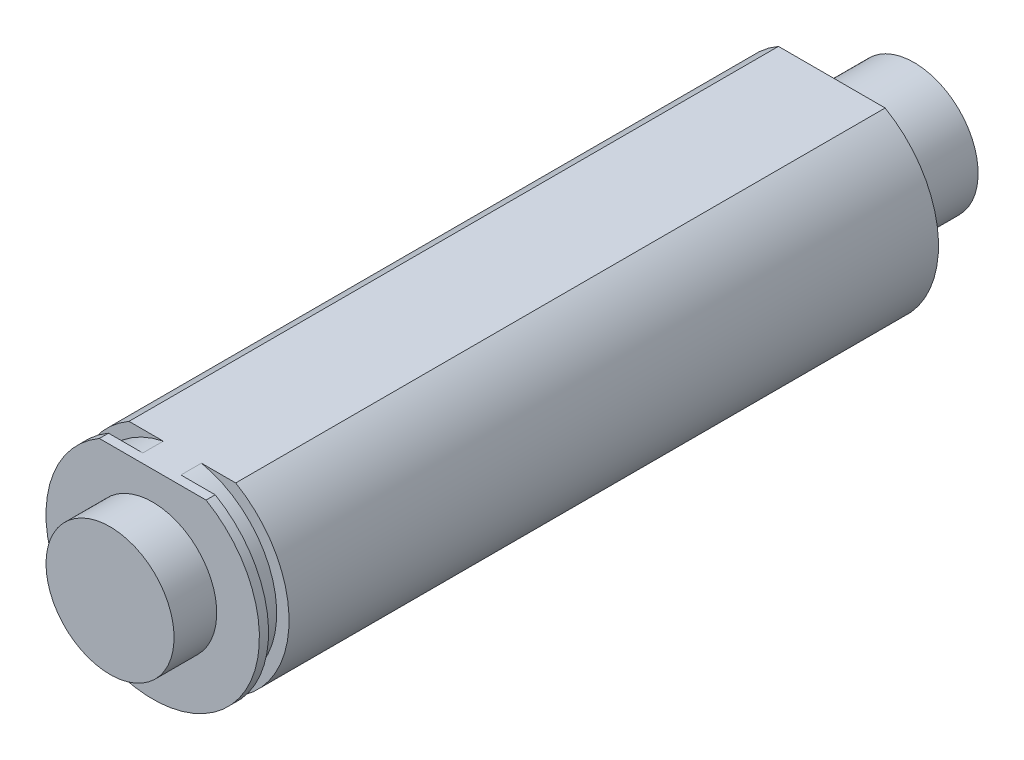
ISO-10303-21;
HEADER;
FILE_DESCRIPTION(('STEP AP214'),'2;1');
FILE_NAME('part.step','',(''),(''),'','','');
FILE_SCHEMA(('AUTOMOTIVE_DESIGN { 1 0 10303 214 1 1 1 1 }'));
ENDSEC;
DATA;
#1=APPLICATION_CONTEXT('core data for automotive mechanical design processes');
#2=APPLICATION_PROTOCOL_DEFINITION('international standard','automotive_design',2000,#1);
#3=PRODUCT_CONTEXT('',#1,'mechanical');
#4=PRODUCT('Part','Part','',(#3));
#5=PRODUCT_RELATED_PRODUCT_CATEGORY('part','',(#4));
#6=PRODUCT_DEFINITION_FORMATION('','',#4);
#7=PRODUCT_DEFINITION_CONTEXT('part definition',#1,'design');
#8=PRODUCT_DEFINITION('design','',#6,#7);
#9=PRODUCT_DEFINITION_SHAPE('','',#8);
#10=(LENGTH_UNIT() NAMED_UNIT(*) SI_UNIT(.MILLI.,.METRE.));
#11=(NAMED_UNIT(*) PLANE_ANGLE_UNIT() SI_UNIT($,.RADIAN.));
#12=(NAMED_UNIT(*) SI_UNIT($,.STERADIAN.) SOLID_ANGLE_UNIT());
#13=UNCERTAINTY_MEASURE_WITH_UNIT(LENGTH_MEASURE(1.E-05),#10,'distance_accuracy_value','');
#14=(GEOMETRIC_REPRESENTATION_CONTEXT(3) GLOBAL_UNCERTAINTY_ASSIGNED_CONTEXT((#13)) GLOBAL_UNIT_ASSIGNED_CONTEXT((#10,
#11,#12)) REPRESENTATION_CONTEXT('',''));
#15=CARTESIAN_POINT('',(0.,0.,0.));
#16=DIRECTION('',(0.,0.,1.));
#17=DIRECTION('',(1.,0.,0.));
#18=AXIS2_PLACEMENT_3D('',#15,#16,#17);
#19=CARTESIAN_POINT('',(0.,0.,152.4));
#20=DIRECTION('',(0.,0.,-1.));
#21=DIRECTION('',(-1.,0.,0.));
#22=AXIS2_PLACEMENT_3D('',#19,#20,#21);
#23=CYLINDRICAL_SURFACE('',#22,7.9375);
#24=CARTESIAN_POINT('',(0.,0.,-88.261902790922));
#25=DIRECTION('',(0.,0.,1.));
#26=DIRECTION('',(1.,0.,0.));
#27=AXIS2_PLACEMENT_3D('',#24,#25,#26);
#28=CIRCLE('',#27,7.93750000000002);
#29=CARTESIAN_POINT('',(-3.96875000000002,6.87407664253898,-88.261902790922));
#30=VERTEX_POINT('',#29);
#31=CARTESIAN_POINT('',(3.96875000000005,6.87407664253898,-88.261902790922));
#32=VERTEX_POINT('',#31);
#33=EDGE_CURVE('E124',#30,#32,#28,.T.);
#34=ORIENTED_EDGE('',*,*,#33,.F.);
#35=DIRECTION('',(0.,0.,1.));
#36=VECTOR('',#35,1.);
#37=CARTESIAN_POINT('',(-3.96875,6.87407664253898,-152.4));
#38=LINE('',#37,#36);
#39=CARTESIAN_POINT('',(-3.96875,6.87407664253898,-136.572201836));
#40=VERTEX_POINT('',#39);
#41=EDGE_CURVE('E120',#40,#30,#38,.T.);
#42=ORIENTED_EDGE('',*,*,#41,.F.);
#43=CARTESIAN_POINT('',(0.,0.,-136.572201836));
#44=DIRECTION('',(0.,0.,-1.));
#45=DIRECTION('',(-1.,0.,0.));
#46=AXIS2_PLACEMENT_3D('',#43,#44,#45);
#47=CIRCLE('',#46,7.9375);
#48=CARTESIAN_POINT('',(3.96875,6.87407664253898,-136.572201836));
#49=VERTEX_POINT('',#48);
#50=EDGE_CURVE('E70',#49,#40,#47,.T.);
#51=ORIENTED_EDGE('',*,*,#50,.F.);
#52=DIRECTION('',(0.,0.,1.));
#53=VECTOR('',#52,1.);
#54=CARTESIAN_POINT('',(3.96875,6.87407664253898,-152.4));
#55=LINE('',#54,#53);
#56=EDGE_CURVE('E129',#49,#32,#55,.T.);
#57=ORIENTED_EDGE('',*,*,#56,.T.);
#58=EDGE_LOOP('',(#34,#42,#51,#57));
#59=FACE_BOUND('',#58,.T.);
#60=ADVANCED_FACE('F48',(#59),#23,.T.);
#61=CARTESIAN_POINT('',(0.,0.,-86.737902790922));
#62=DIRECTION('',(0.,0.,1.));
#63=DIRECTION('',(1.,0.,0.));
#64=AXIS2_PLACEMENT_3D('',#61,#62,#63);
#65=CIRCLE('',#64,7.93750000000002);
#66=CARTESIAN_POINT('',(-3.96875000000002,6.87407664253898,-86.737902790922));
#67=VERTEX_POINT('',#66);
#68=CARTESIAN_POINT('',(3.96875000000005,6.87407664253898,-86.737902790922));
#69=VERTEX_POINT('',#68);
#70=EDGE_CURVE('E101',#67,#69,#65,.T.);
#71=ORIENTED_EDGE('',*,*,#70,.T.);
#72=CARTESIAN_POINT('',(3.96875,6.87407664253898,-86.057548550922));
#73=VERTEX_POINT('',#72);
#74=EDGE_CURVE('E149',#69,#73,#55,.T.);
#75=ORIENTED_EDGE('',*,*,#74,.T.);
#76=CARTESIAN_POINT('',(0.,0.,-86.057548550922));
#77=DIRECTION('',(0.,0.,-1.));
#78=DIRECTION('',(-1.,0.,0.));
#79=AXIS2_PLACEMENT_3D('',#76,#77,#78);
#80=CIRCLE('',#79,7.9375);
#81=CARTESIAN_POINT('',(-3.96875,6.87407664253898,-86.057548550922));
#82=VERTEX_POINT('',#81);
#83=EDGE_CURVE('E137',#73,#82,#80,.T.);
#84=ORIENTED_EDGE('',*,*,#83,.T.);
#85=EDGE_CURVE('E146',#67,#82,#38,.T.);
#86=ORIENTED_EDGE('',*,*,#85,.F.);
#87=EDGE_LOOP('',(#71,#75,#84,#86));
#88=FACE_BOUND('',#87,.T.);
#89=ADVANCED_FACE('F157',(#88),#23,.T.);
#90=CARTESIAN_POINT('',(-3.96875,6.87407664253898,-152.4));
#91=DIRECTION('',(0.,-1.,0.));
#92=DIRECTION('',(0.,0.,-1.));
#93=AXIS2_PLACEMENT_3D('',#90,#91,#92);
#94=PLANE('',#93);
#95=DIRECTION('',(-1.,0.,0.));
#96=VECTOR('',#95,1.);
#97=CARTESIAN_POINT('',(-3.96874999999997,6.87407664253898,-88.261902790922));
#98=LINE('',#97,#96);
#99=CARTESIAN_POINT('',(-1.41811328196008,6.87407664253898,-88.261902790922));
#100=VERTEX_POINT('',#99);
#101=EDGE_CURVE('E12',#100,#30,#98,.T.);
#102=ORIENTED_EDGE('',*,*,#101,.F.);
#103=DIRECTION('',(0.,0.,1.));
#104=VECTOR('',#103,1.);
#105=CARTESIAN_POINT('',(-1.41811328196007,6.87407664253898,-83.930701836));
#106=LINE('',#105,#104);
#107=CARTESIAN_POINT('',(-1.41811328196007,6.87407664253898,-86.737902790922));
#108=VERTEX_POINT('',#107);
#109=EDGE_CURVE('E51',#108,#100,#106,.F.);
#110=ORIENTED_EDGE('',*,*,#109,.F.);
#111=DIRECTION('',(1.,0.,0.));
#112=VECTOR('',#111,1.);
#113=CARTESIAN_POINT('',(-3.96874999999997,6.87407664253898,-86.737902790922));
#114=LINE('',#113,#112);
#115=EDGE_CURVE('E98',#67,#108,#114,.T.);
#116=ORIENTED_EDGE('',*,*,#115,.F.);
#117=ORIENTED_EDGE('',*,*,#85,.T.);
#118=DIRECTION('',(1.,0.,0.));
#119=VECTOR('',#118,1.);
#120=CARTESIAN_POINT('',(-3.96875,6.87407664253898,-86.057548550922));
#121=LINE('',#120,#119);
#122=EDGE_CURVE('E148',#82,#73,#121,.T.);
#123=ORIENTED_EDGE('',*,*,#122,.T.);
#124=ORIENTED_EDGE('',*,*,#74,.F.);
#125=CARTESIAN_POINT('',(1.4181132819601,6.87407664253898,-86.737902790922));
#126=VERTEX_POINT('',#125);
#127=EDGE_CURVE('E106',#126,#69,#114,.T.);
#128=ORIENTED_EDGE('',*,*,#127,.F.);
#129=DIRECTION('',(0.,0.,1.));
#130=VECTOR('',#129,1.);
#131=CARTESIAN_POINT('',(1.41811328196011,6.87407664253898,-83.930701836));
#132=LINE('',#131,#130);
#133=CARTESIAN_POINT('',(1.41811328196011,6.87407664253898,-88.261902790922));
#134=VERTEX_POINT('',#133);
#135=EDGE_CURVE('E112',#134,#126,#132,.T.);
#136=ORIENTED_EDGE('',*,*,#135,.F.);
#137=EDGE_CURVE('E56',#32,#134,#98,.T.);
#138=ORIENTED_EDGE('',*,*,#137,.F.);
#139=ORIENTED_EDGE('',*,*,#56,.F.);
#140=DIRECTION('',(1.,0.,0.));
#141=VECTOR('',#140,1.);
#142=CARTESIAN_POINT('',(-3.96875,6.87407664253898,-136.572201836));
#143=LINE('',#142,#141);
#144=EDGE_CURVE('E153',#40,#49,#143,.T.);
#145=ORIENTED_EDGE('',*,*,#144,.F.);
#146=ORIENTED_EDGE('',*,*,#41,.T.);
#147=EDGE_LOOP('',(#102,#110,#116,#117,#123,#124,#128,#136,#138,#139,#145,#146));
#148=FACE_BOUND('',#147,.T.);
#149=ADVANCED_FACE('F117',(#148),#94,.F.);
#150=CARTESIAN_POINT('',(-7.9375,0.,-86.057548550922));
#151=DIRECTION('',(0.,0.,-1.));
#152=DIRECTION('',(-1.,0.,0.));
#153=AXIS2_PLACEMENT_3D('',#150,#151,#152);
#154=PLANE('',#153);
#155=CARTESIAN_POINT('',(0.,0.,-86.057548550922));
#156=DIRECTION('',(0.,0.,-1.));
#157=DIRECTION('',(-1.,0.,0.));
#158=AXIS2_PLACEMENT_3D('',#155,#156,#157);
#159=CIRCLE('',#158,4.76249999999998);
#160=CARTESIAN_POINT('',(-4.76249999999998,0.,-86.057548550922));
#161=VERTEX_POINT('',#160);
#162=EDGE_CURVE('E140',#161,#161,#159,.T.);
#163=ORIENTED_EDGE('',*,*,#162,.T.);
#164=EDGE_LOOP('',(#163));
#165=FACE_BOUND('',#164,.T.);
#166=ORIENTED_EDGE('',*,*,#83,.F.);
#167=ORIENTED_EDGE('',*,*,#122,.F.);
#168=EDGE_LOOP('',(#166,#167));
#169=FACE_BOUND('',#168,.T.);
#170=ADVANCED_FACE('F187',(#165,#169),#154,.F.);
#171=CARTESIAN_POINT('',(-4.76249999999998,0.,-82.882548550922));
#172=DIRECTION('',(0.,0.,-1.));
#173=DIRECTION('',(-1.,0.,0.));
#174=AXIS2_PLACEMENT_3D('',#171,#172,#173);
#175=PLANE('',#174);
#176=CARTESIAN_POINT('',(0.,0.,-82.882548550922));
#177=DIRECTION('',(0.,0.,-1.));
#178=DIRECTION('',(-1.,0.,0.));
#179=AXIS2_PLACEMENT_3D('',#176,#177,#178);
#180=CIRCLE('',#179,4.76249999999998);
#181=CARTESIAN_POINT('',(-4.76249999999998,0.,-82.882548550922));
#182=VERTEX_POINT('',#181);
#183=EDGE_CURVE('E143',#182,#182,#180,.T.);
#184=ORIENTED_EDGE('',*,*,#183,.F.);
#185=EDGE_LOOP('',(#184));
#186=FACE_BOUND('',#185,.T.);
#187=ADVANCED_FACE('F191',(#186),#175,.F.);
#188=CARTESIAN_POINT('',(0.,0.,0.));
#189=DIRECTION('',(0.,0.,-1.));
#190=DIRECTION('',(-1.,0.,0.));
#191=AXIS2_PLACEMENT_3D('',#188,#189,#190);
#192=CYLINDRICAL_SURFACE('',#191,4.76249999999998);
#193=ORIENTED_EDGE('',*,*,#162,.F.);
#194=EDGE_LOOP('',(#193));
#195=FACE_BOUND('',#194,.T.);
#196=ORIENTED_EDGE('',*,*,#183,.T.);
#197=EDGE_LOOP('',(#196));
#198=FACE_BOUND('',#197,.T.);
#199=ADVANCED_FACE('F177',(#195,#198),#192,.T.);
#200=CARTESIAN_POINT('',(0.,0.,-136.572201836));
#201=DIRECTION('',(0.,0.,-1.));
#202=DIRECTION('',(-1.,0.,0.));
#203=AXIS2_PLACEMENT_3D('',#200,#201,#202);
#204=PLANE('',#203);
#205=CARTESIAN_POINT('',(0.,0.,-136.572201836));
#206=DIRECTION('',(0.,0.,-1.));
#207=DIRECTION('',(-1.,0.,0.));
#208=AXIS2_PLACEMENT_3D('',#205,#206,#207);
#209=CIRCLE('',#208,4.7625);
#210=CARTESIAN_POINT('',(-4.7625,0.,-136.572201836));
#211=VERTEX_POINT('',#210);
#212=EDGE_CURVE('E130',#211,#211,#209,.T.);
#213=ORIENTED_EDGE('',*,*,#212,.F.);
#214=EDGE_LOOP('',(#213));
#215=FACE_BOUND('',#214,.T.);
#216=ORIENTED_EDGE('',*,*,#50,.T.);
#217=ORIENTED_EDGE('',*,*,#144,.T.);
#218=EDGE_LOOP('',(#216,#217));
#219=FACE_BOUND('',#218,.T.);
#220=ADVANCED_FACE('F169',(#215,#219),#204,.T.);
#221=CARTESIAN_POINT('',(0.,0.,-136.572201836));
#222=DIRECTION('',(0.,0.,-1.));
#223=DIRECTION('',(-1.,0.,0.));
#224=AXIS2_PLACEMENT_3D('',#221,#222,#223);
#225=CYLINDRICAL_SURFACE('',#224,4.7625);
#226=CARTESIAN_POINT('',(1.22124532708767E-12,-7.7715611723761E-13,-142.693601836));
#227=DIRECTION('',(0.,0.,-1.));
#228=DIRECTION('',(-1.,0.,0.));
#229=AXIS2_PLACEMENT_3D('',#226,#227,#228);
#230=CIRCLE('',#229,4.76250000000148);
#231=CARTESIAN_POINT('',(-4.7625,0.,-142.693601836));
#232=VERTEX_POINT('',#231);
#233=EDGE_CURVE('E159',#232,#232,#230,.T.);
#234=CARTESIAN_POINT('',(-4.7625,0.,-136.572201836));
#235=CARTESIAN_POINT('',(-4.7625,0.,-136.635966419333));
#236=CARTESIAN_POINT('',(-4.7625,0.,-136.699731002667));
#237=CARTESIAN_POINT('',(-4.7625,0.,-136.827260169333));
#238=CARTESIAN_POINT('',(-4.7625,0.,-136.891024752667));
#239=CARTESIAN_POINT('',(-4.7625,0.,-137.018553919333));
#240=CARTESIAN_POINT('',(-4.7625,0.,-137.082318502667));
#241=CARTESIAN_POINT('',(-4.7625,0.,-137.209847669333));
#242=CARTESIAN_POINT('',(-4.7625,0.,-137.273612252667));
#243=CARTESIAN_POINT('',(-4.7625,0.,-137.401141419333));
#244=CARTESIAN_POINT('',(-4.7625,0.,-137.464906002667));
#245=CARTESIAN_POINT('',(-4.7625,0.,-137.592435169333));
#246=CARTESIAN_POINT('',(-4.7625,0.,-137.656199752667));
#247=CARTESIAN_POINT('',(-4.7625,0.,-137.783728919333));
#248=CARTESIAN_POINT('',(-4.7625,0.,-137.847493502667));
#249=CARTESIAN_POINT('',(-4.7625,0.,-137.975022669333));
#250=CARTESIAN_POINT('',(-4.7625,0.,-138.038787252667));
#251=CARTESIAN_POINT('',(-4.7625,0.,-138.166316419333));
#252=CARTESIAN_POINT('',(-4.7625,0.,-138.230081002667));
#253=CARTESIAN_POINT('',(-4.7625,0.,-138.357610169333));
#254=CARTESIAN_POINT('',(-4.7625,0.,-138.421374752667));
#255=CARTESIAN_POINT('',(-4.7625,0.,-138.548903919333));
#256=CARTESIAN_POINT('',(-4.7625,0.,-138.612668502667));
#257=CARTESIAN_POINT('',(-4.7625,0.,-138.740197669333));
#258=CARTESIAN_POINT('',(-4.7625,0.,-138.803962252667));
#259=CARTESIAN_POINT('',(-4.7625,0.,-138.931491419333));
#260=CARTESIAN_POINT('',(-4.7625,0.,-138.995256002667));
#261=CARTESIAN_POINT('',(-4.7625,0.,-139.122785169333));
#262=CARTESIAN_POINT('',(-4.7625,0.,-139.186549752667));
#263=CARTESIAN_POINT('',(-4.7625,0.,-139.314078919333));
#264=CARTESIAN_POINT('',(-4.7625,0.,-139.377843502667));
#265=CARTESIAN_POINT('',(-4.7625,0.,-139.505372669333));
#266=CARTESIAN_POINT('',(-4.7625,0.,-139.569137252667));
#267=CARTESIAN_POINT('',(-4.7625,0.,-139.696666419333));
#268=CARTESIAN_POINT('',(-4.7625,0.,-139.760431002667));
#269=CARTESIAN_POINT('',(-4.7625,0.,-139.887960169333));
#270=CARTESIAN_POINT('',(-4.7625,0.,-139.951724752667));
#271=CARTESIAN_POINT('',(-4.7625,0.,-140.079253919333));
#272=CARTESIAN_POINT('',(-4.7625,0.,-140.143018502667));
#273=CARTESIAN_POINT('',(-4.7625,0.,-140.270547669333));
#274=CARTESIAN_POINT('',(-4.7625,0.,-140.334312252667));
#275=CARTESIAN_POINT('',(-4.7625,0.,-140.461841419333));
#276=CARTESIAN_POINT('',(-4.7625,0.,-140.525606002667));
#277=CARTESIAN_POINT('',(-4.7625,0.,-140.653135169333));
#278=CARTESIAN_POINT('',(-4.7625,0.,-140.716899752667));
#279=CARTESIAN_POINT('',(-4.7625,0.,-140.844428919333));
#280=CARTESIAN_POINT('',(-4.7625,0.,-140.908193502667));
#281=CARTESIAN_POINT('',(-4.7625,0.,-141.035722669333));
#282=CARTESIAN_POINT('',(-4.7625,0.,-141.099487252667));
#283=CARTESIAN_POINT('',(-4.7625,0.,-141.227016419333));
#284=CARTESIAN_POINT('',(-4.7625,0.,-141.290781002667));
#285=CARTESIAN_POINT('',(-4.7625,0.,-141.418310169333));
#286=CARTESIAN_POINT('',(-4.7625,0.,-141.482074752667));
#287=CARTESIAN_POINT('',(-4.7625,0.,-141.609603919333));
#288=CARTESIAN_POINT('',(-4.7625,0.,-141.673368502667));
#289=CARTESIAN_POINT('',(-4.7625,0.,-141.800897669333));
#290=CARTESIAN_POINT('',(-4.7625,0.,-141.864662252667));
#291=CARTESIAN_POINT('',(-4.7625,0.,-141.992191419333));
#292=CARTESIAN_POINT('',(-4.7625,0.,-142.055956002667));
#293=CARTESIAN_POINT('',(-4.7625,0.,-142.183485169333));
#294=CARTESIAN_POINT('',(-4.7625,0.,-142.247249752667));
#295=CARTESIAN_POINT('',(-4.7625,0.,-142.374778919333));
#296=CARTESIAN_POINT('',(-4.7625,0.,-142.438543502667));
#297=CARTESIAN_POINT('',(-4.7625,0.,-142.566072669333));
#298=CARTESIAN_POINT('',(-4.7625,0.,-142.629837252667));
#299=CARTESIAN_POINT('',(-4.7625,0.,-142.693601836));
#300=B_SPLINE_CURVE_WITH_KNOTS('',3,(#234,#235,#236,#237,#238,#239,#240,#241,#242,#243,#244,
#245,#246,#247,#248,#249,#250,#251,#252,#253,#254,#255,#256,#257,#258,#259,#260,#261,#262,#263,
#264,#265,#266,#267,#268,#269,#270,#271,#272,#273,#274,#275,#276,#277,#278,#279,#280,#281,#282,
#283,#284,#285,#286,#287,#288,#289,#290,#291,#292,#293,#294,#295,#296,#297,#298,#299),
.UNSPECIFIED.,.F.,.F.,(4,2,2,2,2,2,2,2,2,2,2,2,2,2,2,2,2,2,2,2,2,2,2,2,2,2,2,2,2,2,2,2,4),(0.,
0.191293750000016,0.382587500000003,0.573881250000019,0.765175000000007,0.956468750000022,
1.14776250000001,1.33905625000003,1.53035000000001,1.72164375,1.91293750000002,2.10423125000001,
2.29552500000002,2.48681875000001,2.67811250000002,2.86940625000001,3.0607,3.25199375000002,
3.4432875,3.63458125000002,3.82587500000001,4.01716875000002,4.20846250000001,4.39975625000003,
4.59105000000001,4.78234375,4.97363750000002,5.16493125,5.35622500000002,5.54751875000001,
5.73881250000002,5.93010625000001,6.1214),.UNSPECIFIED.);
#301=EDGE_CURVE('BSEAM167',#211,#232,#300,.T.);
#302=ORIENTED_EDGE('',*,*,#212,.T.);
#303=ORIENTED_EDGE('',*,*,#233,.F.);
#304=ORIENTED_EDGE('',*,*,#301,.T.);
#305=ORIENTED_EDGE('',*,*,#301,.F.);
#306=EDGE_LOOP('',(#302,#304,#303,#305));
#307=FACE_BOUND('',#306,.T.);
#308=ADVANCED_FACE('F167',(#307),#225,.T.);
#309=CARTESIAN_POINT('',(-7.9375,0.,-88.261902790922));
#310=DIRECTION('',(0.,0.,1.));
#311=DIRECTION('',(1.,0.,0.));
#312=AXIS2_PLACEMENT_3D('',#309,#310,#311);
#313=PLANE('',#312);
#314=ORIENTED_EDGE('',*,*,#137,.T.);
#315=CARTESIAN_POINT('',(0.,0.,-88.261902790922));
#316=DIRECTION('',(0.,0.,1.));
#317=DIRECTION('',(1.,0.,0.));
#318=AXIS2_PLACEMENT_3D('',#315,#316,#317);
#319=CIRCLE('',#318,7.01883002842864);
#320=EDGE_CURVE('E114',#100,#134,#319,.T.);
#321=ORIENTED_EDGE('',*,*,#320,.F.);
#322=ORIENTED_EDGE('',*,*,#101,.T.);
#323=ORIENTED_EDGE('',*,*,#33,.T.);
#324=EDGE_LOOP('',(#314,#321,#322,#323));
#325=FACE_BOUND('',#324,.T.);
#326=ADVANCED_FACE('F123',(#325),#313,.T.);
#327=CARTESIAN_POINT('',(0.,0.,-83.930701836));
#328=DIRECTION('',(0.,0.,1.));
#329=DIRECTION('',(1.,0.,0.));
#330=AXIS2_PLACEMENT_3D('',#327,#328,#329);
#331=CYLINDRICAL_SURFACE('',#330,7.01883002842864);
#332=ORIENTED_EDGE('',*,*,#135,.T.);
#333=CARTESIAN_POINT('',(0.,0.,-86.737902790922));
#334=DIRECTION('',(0.,0.,1.));
#335=DIRECTION('',(1.,0.,0.));
#336=AXIS2_PLACEMENT_3D('',#333,#334,#335);
#337=CIRCLE('',#336,7.01883002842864);
#338=EDGE_CURVE('E63',#108,#126,#337,.T.);
#339=ORIENTED_EDGE('',*,*,#338,.F.);
#340=ORIENTED_EDGE('',*,*,#109,.T.);
#341=ORIENTED_EDGE('',*,*,#320,.T.);
#342=EDGE_LOOP('',(#332,#339,#340,#341));
#343=FACE_BOUND('',#342,.T.);
#344=ADVANCED_FACE('F108',(#343),#331,.T.);
#345=CARTESIAN_POINT('',(-7.9375,0.,-86.737902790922));
#346=DIRECTION('',(0.,0.,-1.));
#347=DIRECTION('',(-1.,0.,0.));
#348=AXIS2_PLACEMENT_3D('',#345,#346,#347);
#349=PLANE('',#348);
#350=ORIENTED_EDGE('',*,*,#115,.T.);
#351=ORIENTED_EDGE('',*,*,#338,.T.);
#352=ORIENTED_EDGE('',*,*,#127,.T.);
#353=ORIENTED_EDGE('',*,*,#70,.F.);
#354=EDGE_LOOP('',(#350,#351,#352,#353));
#355=FACE_BOUND('',#354,.T.);
#356=ADVANCED_FACE('F99',(#355),#349,.T.);
#357=CARTESIAN_POINT('',(1.22124532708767E-12,-7.7715611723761E-13,-142.693601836));
#358=DIRECTION('',(0.,0.,-1.));
#359=DIRECTION('',(-1.,0.,0.));
#360=AXIS2_PLACEMENT_3D('',#357,#358,#359);
#361=PLANE('',#360);
#362=ORIENTED_EDGE('',*,*,#233,.T.);
#363=EDGE_LOOP('',(#362));
#364=FACE_BOUND('',#363,.T.);
#365=ADVANCED_FACE('F165',(#364),#361,.T.);
#366=CLOSED_SHELL('',(#60,#89,#149,#170,#187,#199,#220,#308,#326,#344,#356,#365));
#367=MANIFOLD_SOLID_BREP('B2',#366);
#368=ADVANCED_BREP_SHAPE_REPRESENTATION('',(#18,#367),#14);
#369=SHAPE_DEFINITION_REPRESENTATION(#9,#368);
ENDSEC;
END-ISO-10303-21;
